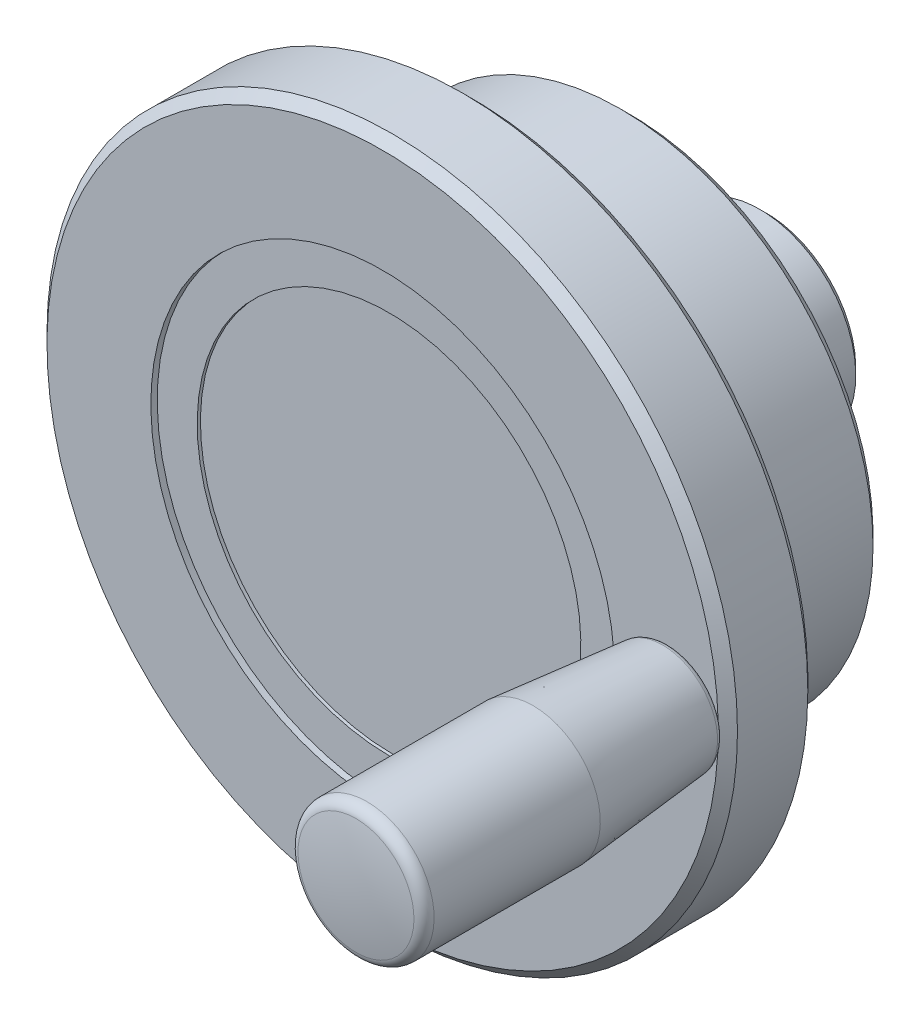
ISO-10303-21;
HEADER;
FILE_DESCRIPTION(('STEP AP214'),'2;1');
FILE_NAME('part.step','',(''),(''),'','','');
FILE_SCHEMA(('AUTOMOTIVE_DESIGN { 1 0 10303 214 1 1 1 1 }'));
ENDSEC;
DATA;
#1=APPLICATION_CONTEXT('core data for automotive mechanical design processes');
#2=APPLICATION_PROTOCOL_DEFINITION('international standard','automotive_design',2000,#1);
#3=PRODUCT_CONTEXT('',#1,'mechanical');
#4=PRODUCT('Part','Part','',(#3));
#5=PRODUCT_RELATED_PRODUCT_CATEGORY('part','',(#4));
#6=PRODUCT_DEFINITION_FORMATION('','',#4);
#7=PRODUCT_DEFINITION_CONTEXT('part definition',#1,'design');
#8=PRODUCT_DEFINITION('design','',#6,#7);
#9=PRODUCT_DEFINITION_SHAPE('','',#8);
#10=(LENGTH_UNIT() NAMED_UNIT(*) SI_UNIT(.MILLI.,.METRE.));
#11=(NAMED_UNIT(*) PLANE_ANGLE_UNIT() SI_UNIT($,.RADIAN.));
#12=(NAMED_UNIT(*) SI_UNIT($,.STERADIAN.) SOLID_ANGLE_UNIT());
#13=UNCERTAINTY_MEASURE_WITH_UNIT(LENGTH_MEASURE(1.E-05),#10,'distance_accuracy_value','');
#14=(GEOMETRIC_REPRESENTATION_CONTEXT(3) GLOBAL_UNCERTAINTY_ASSIGNED_CONTEXT((#13)) GLOBAL_UNIT_ASSIGNED_CONTEXT((#10,
#11,#12)) REPRESENTATION_CONTEXT('',''));
#15=CARTESIAN_POINT('',(0.,0.,0.));
#16=DIRECTION('',(0.,0.,1.));
#17=DIRECTION('',(1.,0.,0.));
#18=AXIS2_PLACEMENT_3D('',#15,#16,#17);
#19=CARTESIAN_POINT('',(0.,0.,0.));
#20=DIRECTION('',(0.,0.,1.));
#21=DIRECTION('',(0.,-1.,0.));
#22=AXIS2_PLACEMENT_3D('',#19,#20,#21);
#23=PLANE('',#22);
#24=CARTESIAN_POINT('',(0.,0.,0.));
#25=DIRECTION('',(0.,0.,1.));
#26=DIRECTION('',(0.,-1.,0.));
#27=AXIS2_PLACEMENT_3D('',#24,#25,#26);
#28=CIRCLE('',#27,14.);
#29=CARTESIAN_POINT('',(0.,-14.,0.));
#30=VERTEX_POINT('',#29);
#31=EDGE_CURVE('E61',#30,#30,#28,.T.);
#32=ORIENTED_EDGE('',*,*,#31,.F.);
#33=EDGE_LOOP('',(#32));
#34=FACE_BOUND('',#33,.T.);
#35=ADVANCED_FACE('F12',(#34),#23,.F.);
#36=CARTESIAN_POINT('',(-52.5,0.,60.));
#37=DIRECTION('',(0.,0.,-1.));
#38=DIRECTION('',(0.,1.,0.));
#39=AXIS2_PLACEMENT_3D('',#36,#37,#38);
#40=PLANE('',#39);
#41=CARTESIAN_POINT('',(45.,0.,60.));
#42=DIRECTION('',(0.,0.,-1.));
#43=DIRECTION('',(0.,1.,0.));
#44=AXIS2_PLACEMENT_3D('',#41,#42,#43);
#45=CIRCLE('',#44,5.);
#46=CARTESIAN_POINT('',(45.,5.,60.));
#47=VERTEX_POINT('',#46);
#48=EDGE_CURVE('E94',#47,#47,#45,.T.);
#49=ORIENTED_EDGE('',*,*,#48,.T.);
#50=EDGE_LOOP('',(#49));
#51=FACE_BOUND('',#50,.T.);
#52=CARTESIAN_POINT('',(0.,0.,60.));
#53=DIRECTION('',(0.,0.,1.));
#54=DIRECTION('',(0.,-1.,0.));
#55=AXIS2_PLACEMENT_3D('',#52,#53,#54);
#56=CIRCLE('',#55,36.25);
#57=CARTESIAN_POINT('',(0.,-36.25,60.));
#58=VERTEX_POINT('',#57);
#59=EDGE_CURVE('E67',#58,#58,#56,.T.);
#60=ORIENTED_EDGE('',*,*,#59,.F.);
#61=EDGE_LOOP('',(#60));
#62=FACE_BOUND('',#61,.T.);
#63=CARTESIAN_POINT('',(0.,0.,60.));
#64=DIRECTION('',(0.,0.,1.));
#65=DIRECTION('',(0.,-1.,0.));
#66=AXIS2_PLACEMENT_3D('',#63,#64,#65);
#67=CIRCLE('',#66,52.5);
#68=CARTESIAN_POINT('',(0.,-52.5,60.));
#69=VERTEX_POINT('',#68);
#70=EDGE_CURVE('E8',#69,#69,#67,.T.);
#71=ORIENTED_EDGE('',*,*,#70,.T.);
#72=EDGE_LOOP('',(#71));
#73=FACE_BOUND('',#72,.T.);
#74=ADVANCED_FACE('F98',(#51,#62,#73),#40,.F.);
#75=CARTESIAN_POINT('',(0.,0.,60.));
#76=DIRECTION('',(0.,0.,-1.));
#77=DIRECTION('',(0.,1.,0.));
#78=AXIS2_PLACEMENT_3D('',#75,#76,#77);
#79=CONICAL_SURFACE('',#78,52.5,0.785398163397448);
#80=CARTESIAN_POINT('',(0.,0.,58.5));
#81=DIRECTION('',(0.,0.,1.));
#82=DIRECTION('',(0.,-1.,0.));
#83=AXIS2_PLACEMENT_3D('',#80,#81,#82);
#84=CIRCLE('',#83,54.);
#85=CARTESIAN_POINT('',(0.,-54.,58.5));
#86=VERTEX_POINT('',#85);
#87=EDGE_CURVE('E18',#86,#86,#84,.T.);
#88=ORIENTED_EDGE('',*,*,#87,.T.);
#89=EDGE_LOOP('',(#88));
#90=FACE_BOUND('',#89,.T.);
#91=ORIENTED_EDGE('',*,*,#70,.F.);
#92=EDGE_LOOP('',(#91));
#93=FACE_BOUND('',#92,.T.);
#94=ADVANCED_FACE('F120',(#90,#93),#79,.T.);
#95=CARTESIAN_POINT('',(0.,0.,67.681471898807));
#96=DIRECTION('',(0.,0.,1.));
#97=DIRECTION('',(0.,-1.,0.));
#98=AXIS2_PLACEMENT_3D('',#95,#96,#97);
#99=CYLINDRICAL_SURFACE('',#98,54.);
#100=ORIENTED_EDGE('',*,*,#87,.F.);
#101=EDGE_LOOP('',(#100));
#102=FACE_BOUND('',#101,.T.);
#103=CARTESIAN_POINT('',(0.,0.,47.5));
#104=DIRECTION('',(0.,0.,1.));
#105=DIRECTION('',(0.,-1.,0.));
#106=AXIS2_PLACEMENT_3D('',#103,#104,#105);
#107=CIRCLE('',#106,54.);
#108=CARTESIAN_POINT('',(0.,-54.,47.5));
#109=VERTEX_POINT('',#108);
#110=EDGE_CURVE('E22',#109,#109,#107,.T.);
#111=ORIENTED_EDGE('',*,*,#110,.T.);
#112=EDGE_LOOP('',(#111));
#113=FACE_BOUND('',#112,.T.);
#114=ADVANCED_FACE('F354',(#102,#113),#99,.T.);
#115=CARTESIAN_POINT('',(0.,0.,46.));
#116=DIRECTION('',(0.,0.,1.));
#117=DIRECTION('',(0.,-1.,0.));
#118=AXIS2_PLACEMENT_3D('',#115,#116,#117);
#119=CONICAL_SURFACE('',#118,52.5,0.785398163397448);
#120=ORIENTED_EDGE('',*,*,#110,.F.);
#121=EDGE_LOOP('',(#120));
#122=FACE_BOUND('',#121,.T.);
#123=CARTESIAN_POINT('',(0.,0.,46.));
#124=DIRECTION('',(0.,0.,1.));
#125=DIRECTION('',(0.,-1.,0.));
#126=AXIS2_PLACEMENT_3D('',#123,#124,#125);
#127=CIRCLE('',#126,52.5);
#128=CARTESIAN_POINT('',(0.,-52.5,46.));
#129=VERTEX_POINT('',#128);
#130=EDGE_CURVE('E26',#129,#129,#127,.T.);
#131=ORIENTED_EDGE('',*,*,#130,.T.);
#132=EDGE_LOOP('',(#131));
#133=FACE_BOUND('',#132,.T.);
#134=ADVANCED_FACE('F345',(#122,#133),#119,.T.);
#135=CARTESIAN_POINT('',(-52.5,0.,46.));
#136=DIRECTION('',(0.,0.,-1.));
#137=DIRECTION('',(0.,1.,0.));
#138=AXIS2_PLACEMENT_3D('',#135,#136,#137);
#139=PLANE('',#138);
#140=CARTESIAN_POINT('',(0.,0.,46.));
#141=DIRECTION('',(0.,0.,1.));
#142=DIRECTION('',(0.,-1.,0.));
#143=AXIS2_PLACEMENT_3D('',#140,#141,#142);
#144=CIRCLE('',#143,41.5);
#145=CARTESIAN_POINT('',(0.,-41.5,46.));
#146=VERTEX_POINT('',#145);
#147=EDGE_CURVE('E31',#146,#146,#144,.T.);
#148=ORIENTED_EDGE('',*,*,#147,.T.);
#149=EDGE_LOOP('',(#148));
#150=FACE_BOUND('',#149,.T.);
#151=ORIENTED_EDGE('',*,*,#130,.F.);
#152=EDGE_LOOP('',(#151));
#153=FACE_BOUND('',#152,.T.);
#154=ADVANCED_FACE('F336',(#150,#153),#139,.T.);
#155=CARTESIAN_POINT('',(0.,0.,44.));
#156=DIRECTION('',(0.,0.,1.));
#157=DIRECTION('',(0.,-1.,0.));
#158=AXIS2_PLACEMENT_3D('',#155,#156,#157);
#159=TOROIDAL_SURFACE('',#158,41.5,2.);
#160=ORIENTED_EDGE('',*,*,#147,.F.);
#161=EDGE_LOOP('',(#160));
#162=FACE_BOUND('',#161,.T.);
#163=CARTESIAN_POINT('',(0.,0.,44.));
#164=DIRECTION('',(0.,0.,1.));
#165=DIRECTION('',(0.,-1.,0.));
#166=AXIS2_PLACEMENT_3D('',#163,#164,#165);
#167=CIRCLE('',#166,39.5);
#168=CARTESIAN_POINT('',(0.,-39.5,44.));
#169=VERTEX_POINT('',#168);
#170=EDGE_CURVE('E34',#169,#169,#167,.T.);
#171=ORIENTED_EDGE('',*,*,#170,.T.);
#172=EDGE_LOOP('',(#171));
#173=FACE_BOUND('',#172,.T.);
#174=ADVANCED_FACE('F327',(#162,#173),#159,.F.);
#175=CARTESIAN_POINT('',(0.,0.,67.681471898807));
#176=DIRECTION('',(0.,0.,1.));
#177=DIRECTION('',(0.,-1.,0.));
#178=AXIS2_PLACEMENT_3D('',#175,#176,#177);
#179=CYLINDRICAL_SURFACE('',#178,39.5);
#180=CARTESIAN_POINT('',(0.,0.,22.8));
#181=DIRECTION('',(0.,0.,1.));
#182=DIRECTION('',(0.,-1.,0.));
#183=AXIS2_PLACEMENT_3D('',#180,#181,#182);
#184=CIRCLE('',#183,39.5);
#185=CARTESIAN_POINT('',(0.,-39.5,22.8));
#186=VERTEX_POINT('',#185);
#187=EDGE_CURVE('E37',#186,#186,#184,.T.);
#188=ORIENTED_EDGE('',*,*,#187,.T.);
#189=EDGE_LOOP('',(#188));
#190=FACE_BOUND('',#189,.T.);
#191=ORIENTED_EDGE('',*,*,#170,.F.);
#192=EDGE_LOOP('',(#191));
#193=FACE_BOUND('',#192,.T.);
#194=ADVANCED_FACE('F318',(#190,#193),#179,.T.);
#195=CARTESIAN_POINT('',(0.,0.,21.3));
#196=DIRECTION('',(0.,0.,1.));
#197=DIRECTION('',(0.,-1.,0.));
#198=AXIS2_PLACEMENT_3D('',#195,#196,#197);
#199=CONICAL_SURFACE('',#198,38.,0.785398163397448);
#200=ORIENTED_EDGE('',*,*,#187,.F.);
#201=EDGE_LOOP('',(#200));
#202=FACE_BOUND('',#201,.T.);
#203=CARTESIAN_POINT('',(0.,0.,21.3));
#204=DIRECTION('',(0.,0.,1.));
#205=DIRECTION('',(0.,-1.,0.));
#206=AXIS2_PLACEMENT_3D('',#203,#204,#205);
#207=CIRCLE('',#206,38.);
#208=CARTESIAN_POINT('',(0.,-38.,21.3));
#209=VERTEX_POINT('',#208);
#210=EDGE_CURVE('E40',#209,#209,#207,.T.);
#211=ORIENTED_EDGE('',*,*,#210,.T.);
#212=EDGE_LOOP('',(#211));
#213=FACE_BOUND('',#212,.T.);
#214=ADVANCED_FACE('F309',(#202,#213),#199,.T.);
#215=CARTESIAN_POINT('',(-25.,0.,21.3));
#216=DIRECTION('',(0.,0.,1.));
#217=DIRECTION('',(0.,-1.,0.));
#218=AXIS2_PLACEMENT_3D('',#215,#216,#217);
#219=PLANE('',#218);
#220=ORIENTED_EDGE('',*,*,#210,.F.);
#221=EDGE_LOOP('',(#220));
#222=FACE_BOUND('',#221,.T.);
#223=CARTESIAN_POINT('',(0.,0.,21.3));
#224=DIRECTION('',(0.,0.,1.));
#225=DIRECTION('',(0.,-1.,0.));
#226=AXIS2_PLACEMENT_3D('',#223,#224,#225);
#227=CIRCLE('',#226,25.);
#228=CARTESIAN_POINT('',(0.,-25.,21.3));
#229=VERTEX_POINT('',#228);
#230=EDGE_CURVE('E43',#229,#229,#227,.T.);
#231=ORIENTED_EDGE('',*,*,#230,.T.);
#232=EDGE_LOOP('',(#231));
#233=FACE_BOUND('',#232,.T.);
#234=ADVANCED_FACE('F300',(#222,#233),#219,.F.);
#235=CARTESIAN_POINT('',(0.,0.,19.3));
#236=DIRECTION('',(0.,0.,1.));
#237=DIRECTION('',(0.,-1.,0.));
#238=AXIS2_PLACEMENT_3D('',#235,#236,#237);
#239=TOROIDAL_SURFACE('',#238,25.,2.);
#240=ORIENTED_EDGE('',*,*,#230,.F.);
#241=EDGE_LOOP('',(#240));
#242=FACE_BOUND('',#241,.T.);
#243=CARTESIAN_POINT('',(0.,0.,19.3));
#244=DIRECTION('',(0.,0.,1.));
#245=DIRECTION('',(0.,-1.,0.));
#246=AXIS2_PLACEMENT_3D('',#243,#244,#245);
#247=CIRCLE('',#246,23.);
#248=CARTESIAN_POINT('',(0.,-23.,19.3));
#249=VERTEX_POINT('',#248);
#250=EDGE_CURVE('E46',#249,#249,#247,.T.);
#251=ORIENTED_EDGE('',*,*,#250,.T.);
#252=EDGE_LOOP('',(#251));
#253=FACE_BOUND('',#252,.T.);
#254=ADVANCED_FACE('F291',(#242,#253),#239,.F.);
#255=CARTESIAN_POINT('',(0.,0.,67.681471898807));
#256=DIRECTION('',(0.,0.,1.));
#257=DIRECTION('',(0.,-1.,0.));
#258=AXIS2_PLACEMENT_3D('',#255,#256,#257);
#259=CYLINDRICAL_SURFACE('',#258,23.);
#260=CARTESIAN_POINT('',(0.,0.,13.9));
#261=DIRECTION('',(0.,0.,1.));
#262=DIRECTION('',(0.,-1.,0.));
#263=AXIS2_PLACEMENT_3D('',#260,#261,#262);
#264=CIRCLE('',#263,23.);
#265=CARTESIAN_POINT('',(0.,-23.,13.9));
#266=VERTEX_POINT('',#265);
#267=EDGE_CURVE('E49',#266,#266,#264,.T.);
#268=ORIENTED_EDGE('',*,*,#267,.T.);
#269=EDGE_LOOP('',(#268));
#270=FACE_BOUND('',#269,.T.);
#271=ORIENTED_EDGE('',*,*,#250,.F.);
#272=EDGE_LOOP('',(#271));
#273=FACE_BOUND('',#272,.T.);
#274=ADVANCED_FACE('F282',(#270,#273),#259,.T.);
#275=CARTESIAN_POINT('',(0.,0.,13.9999984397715));
#276=DIRECTION('',(0.,0.,1.));
#277=DIRECTION('',(0.,-1.,0.));
#278=AXIS2_PLACEMENT_3D('',#275,#276,#277);
#279=TOROIDAL_SURFACE('',#278,21.0025014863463,2.00000000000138);
#280=CARTESIAN_POINT('',(0.,0.,12.));
#281=DIRECTION('',(0.,0.,1.));
#282=DIRECTION('',(0.,-1.,0.));
#283=AXIS2_PLACEMENT_3D('',#280,#281,#282);
#284=CIRCLE('',#283,21.0000033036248);
#285=CARTESIAN_POINT('',(0.,-21.0000033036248,12.));
#286=VERTEX_POINT('',#285);
#287=EDGE_CURVE('E52',#286,#286,#284,.T.);
#288=ORIENTED_EDGE('',*,*,#287,.T.);
#289=EDGE_LOOP('',(#288));
#290=FACE_BOUND('',#289,.T.);
#291=ORIENTED_EDGE('',*,*,#267,.F.);
#292=EDGE_LOOP('',(#291));
#293=FACE_BOUND('',#292,.T.);
#294=ADVANCED_FACE('F274',(#290,#293),#279,.T.);
#295=CARTESIAN_POINT('',(-15.,0.,12.));
#296=DIRECTION('',(0.,0.,1.));
#297=DIRECTION('',(0.,-1.,0.));
#298=AXIS2_PLACEMENT_3D('',#295,#296,#297);
#299=PLANE('',#298);
#300=ORIENTED_EDGE('',*,*,#287,.F.);
#301=EDGE_LOOP('',(#300));
#302=FACE_BOUND('',#301,.T.);
#303=CARTESIAN_POINT('',(0.,0.,12.));
#304=DIRECTION('',(0.,0.,1.));
#305=DIRECTION('',(0.,-1.,0.));
#306=AXIS2_PLACEMENT_3D('',#303,#304,#305);
#307=CIRCLE('',#306,15.);
#308=CARTESIAN_POINT('',(0.,-15.,12.));
#309=VERTEX_POINT('',#308);
#310=EDGE_CURVE('E55',#309,#309,#307,.T.);
#311=ORIENTED_EDGE('',*,*,#310,.T.);
#312=EDGE_LOOP('',(#311));
#313=FACE_BOUND('',#312,.T.);
#314=ADVANCED_FACE('F138',(#302,#313),#299,.F.);
#315=CARTESIAN_POINT('',(0.,0.,67.681471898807));
#316=DIRECTION('',(0.,0.,1.));
#317=DIRECTION('',(0.,-1.,0.));
#318=AXIS2_PLACEMENT_3D('',#315,#316,#317);
#319=CYLINDRICAL_SURFACE('',#318,15.);
#320=CARTESIAN_POINT('',(0.,0.,1.));
#321=DIRECTION('',(0.,0.,1.));
#322=DIRECTION('',(0.,-1.,0.));
#323=AXIS2_PLACEMENT_3D('',#320,#321,#322);
#324=CIRCLE('',#323,15.);
#325=CARTESIAN_POINT('',(0.,-15.,1.));
#326=VERTEX_POINT('',#325);
#327=EDGE_CURVE('E58',#326,#326,#324,.T.);
#328=ORIENTED_EDGE('',*,*,#327,.T.);
#329=EDGE_LOOP('',(#328));
#330=FACE_BOUND('',#329,.T.);
#331=ORIENTED_EDGE('',*,*,#310,.F.);
#332=EDGE_LOOP('',(#331));
#333=FACE_BOUND('',#332,.T.);
#334=ADVANCED_FACE('F126',(#330,#333),#319,.T.);
#335=CARTESIAN_POINT('',(0.,0.,0.));
#336=DIRECTION('',(0.,0.,1.));
#337=DIRECTION('',(0.,-1.,0.));
#338=AXIS2_PLACEMENT_3D('',#335,#336,#337);
#339=CONICAL_SURFACE('',#338,14.,0.785398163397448);
#340=ORIENTED_EDGE('',*,*,#327,.F.);
#341=EDGE_LOOP('',(#340));
#342=FACE_BOUND('',#341,.T.);
#343=ORIENTED_EDGE('',*,*,#31,.T.);
#344=EDGE_LOOP('',(#343));
#345=FACE_BOUND('',#344,.T.);
#346=ADVANCED_FACE('F123',(#342,#345),#339,.T.);
#347=CARTESIAN_POINT('',(0.,0.,59.));
#348=DIRECTION('',(0.,0.,1.));
#349=DIRECTION('',(0.,-1.,0.));
#350=AXIS2_PLACEMENT_3D('',#347,#348,#349);
#351=CYLINDRICAL_SURFACE('',#350,36.25);
#352=CARTESIAN_POINT('',(0.,0.,59.));
#353=DIRECTION('',(0.,0.,1.));
#354=DIRECTION('',(0.,-1.,0.));
#355=AXIS2_PLACEMENT_3D('',#352,#353,#354);
#356=CIRCLE('',#355,36.25);
#357=CARTESIAN_POINT('',(0.,-36.25,59.));
#358=VERTEX_POINT('',#357);
#359=EDGE_CURVE('E64',#358,#358,#356,.T.);
#360=ORIENTED_EDGE('',*,*,#359,.F.);
#361=EDGE_LOOP('',(#360));
#362=FACE_BOUND('',#361,.T.);
#363=ORIENTED_EDGE('',*,*,#59,.T.);
#364=EDGE_LOOP('',(#363));
#365=FACE_BOUND('',#364,.T.);
#366=ADVANCED_FACE('F125',(#362,#365),#351,.F.);
#367=CARTESIAN_POINT('',(0.,0.,59.));
#368=DIRECTION('',(0.,0.,1.));
#369=DIRECTION('',(0.,-1.,0.));
#370=AXIS2_PLACEMENT_3D('',#367,#368,#369);
#371=PLANE('',#370);
#372=CARTESIAN_POINT('',(0.,0.,59.));
#373=DIRECTION('',(0.,0.,1.));
#374=DIRECTION('',(0.,-1.,0.));
#375=AXIS2_PLACEMENT_3D('',#372,#373,#374);
#376=CIRCLE('',#375,30.);
#377=CARTESIAN_POINT('',(0.,-30.,59.));
#378=VERTEX_POINT('',#377);
#379=EDGE_CURVE('E70',#378,#378,#376,.T.);
#380=ORIENTED_EDGE('',*,*,#379,.F.);
#381=EDGE_LOOP('',(#380));
#382=FACE_BOUND('',#381,.T.);
#383=ORIENTED_EDGE('',*,*,#359,.T.);
#384=EDGE_LOOP('',(#383));
#385=FACE_BOUND('',#384,.T.);
#386=ADVANCED_FACE('F129',(#382,#385),#371,.T.);
#387=CARTESIAN_POINT('',(0.,0.,58.5));
#388=DIRECTION('',(0.,0.,1.));
#389=DIRECTION('',(0.,-1.,0.));
#390=AXIS2_PLACEMENT_3D('',#387,#388,#389);
#391=CYLINDRICAL_SURFACE('',#390,30.);
#392=ORIENTED_EDGE('',*,*,#379,.T.);
#393=EDGE_LOOP('',(#392));
#394=FACE_BOUND('',#393,.T.);
#395=CARTESIAN_POINT('',(0.,0.,58.5));
#396=DIRECTION('',(0.,0.,1.));
#397=DIRECTION('',(0.,-1.,0.));
#398=AXIS2_PLACEMENT_3D('',#395,#396,#397);
#399=CIRCLE('',#398,30.);
#400=CARTESIAN_POINT('',(0.,-30.,58.5));
#401=VERTEX_POINT('',#400);
#402=EDGE_CURVE('E73',#401,#401,#399,.T.);
#403=ORIENTED_EDGE('',*,*,#402,.F.);
#404=EDGE_LOOP('',(#403));
#405=FACE_BOUND('',#404,.T.);
#406=ADVANCED_FACE('F143',(#394,#405),#391,.F.);
#407=CARTESIAN_POINT('',(0.,0.,58.5));
#408=DIRECTION('',(0.,0.,1.));
#409=DIRECTION('',(0.,-1.,0.));
#410=AXIS2_PLACEMENT_3D('',#407,#408,#409);
#411=PLANE('',#410);
#412=ORIENTED_EDGE('',*,*,#402,.T.);
#413=EDGE_LOOP('',(#412));
#414=FACE_BOUND('',#413,.T.);
#415=ADVANCED_FACE('F137',(#414),#411,.T.);
#416=CARTESIAN_POINT('',(45.,0.,60.));
#417=DIRECTION('',(0.,-1.,0.));
#418=DIRECTION('',(0.,0.,-1.));
#419=AXIS2_PLACEMENT_3D('',#416,#417,#418);
#420=SPHERICAL_SURFACE('',#419,50.);
#421=CARTESIAN_POINT('',(45.,0.,60.));
#422=DIRECTION('',(0.,0.,-1.));
#423=DIRECTION('',(0.,1.,0.));
#424=AXIS2_PLACEMENT_3D('',#421,#422,#423);
#425=SPHERICAL_SURFACE('',#424,50.);
#426=CARTESIAN_POINT('',(45.,0.,109.170957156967));
#427=DIRECTION('',(0.,0.,-1.));
#428=DIRECTION('',(0.,1.,0.));
#429=AXIS2_PLACEMENT_3D('',#426,#427,#428);
#430=CIRCLE('',#429,9.06735751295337);
#431=CARTESIAN_POINT('',(45.,9.06735751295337,109.170957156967));
#432=VERTEX_POINT('',#431);
#433=EDGE_CURVE('E76',#432,#432,#430,.T.);
#434=ORIENTED_EDGE('',*,*,#433,.F.);
#435=EDGE_LOOP('',(#434));
#436=FACE_BOUND('',#435,.T.);
#437=ADVANCED_FACE('F152',(#436),#425,.T.);
#438=CARTESIAN_POINT('',(45.,0.,107.449973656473));
#439=DIRECTION('',(0.,0.,-1.));
#440=DIRECTION('',(0.,1.,0.));
#441=AXIS2_PLACEMENT_3D('',#438,#439,#440);
#442=TOROIDAL_SURFACE('',#441,8.75,1.75);
#443=CARTESIAN_POINT('',(45.,0.,107.449973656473));
#444=DIRECTION('',(0.,0.,-1.));
#445=DIRECTION('',(0.,1.,0.));
#446=AXIS2_PLACEMENT_3D('',#443,#444,#445);
#447=CIRCLE('',#446,10.5);
#448=CARTESIAN_POINT('',(45.,10.5,107.449973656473));
#449=VERTEX_POINT('',#448);
#450=EDGE_CURVE('E79',#449,#449,#447,.T.);
#451=ORIENTED_EDGE('',*,*,#450,.F.);
#452=EDGE_LOOP('',(#451));
#453=FACE_BOUND('',#452,.T.);
#454=ORIENTED_EDGE('',*,*,#433,.T.);
#455=EDGE_LOOP('',(#454));
#456=FACE_BOUND('',#455,.T.);
#457=ADVANCED_FACE('F161',(#453,#456),#442,.T.);
#458=CARTESIAN_POINT('',(45.,0.,53.1581982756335));
#459=DIRECTION('',(0.,0.,-1.));
#460=DIRECTION('',(0.,1.,0.));
#461=AXIS2_PLACEMENT_3D('',#458,#459,#460);
#462=CYLINDRICAL_SURFACE('',#461,10.5);
#463=CARTESIAN_POINT('',(45.,0.,81.457789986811));
#464=DIRECTION('',(0.,0.,-1.));
#465=DIRECTION('',(0.,1.,0.));
#466=AXIS2_PLACEMENT_3D('',#463,#464,#465);
#467=CIRCLE('',#466,10.5);
#468=CARTESIAN_POINT('',(45.,10.5,81.457789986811));
#469=VERTEX_POINT('',#468);
#470=EDGE_CURVE('E82',#469,#469,#467,.T.);
#471=ORIENTED_EDGE('',*,*,#470,.F.);
#472=EDGE_LOOP('',(#471));
#473=FACE_BOUND('',#472,.T.);
#474=ORIENTED_EDGE('',*,*,#450,.T.);
#475=EDGE_LOOP('',(#474));
#476=FACE_BOUND('',#475,.T.);
#477=ADVANCED_FACE('F165',(#473,#476),#462,.T.);
#478=CARTESIAN_POINT('',(45.,0.,61.2058916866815));
#479=DIRECTION('',(0.,0.,1.));
#480=DIRECTION('',(0.,-1.,0.));
#481=AXIS2_PLACEMENT_3D('',#478,#479,#480);
#482=CONICAL_SURFACE('',#481,8.58563197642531,0.0942477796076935);
#483=ORIENTED_EDGE('',*,*,#470,.T.);
#484=EDGE_LOOP('',(#483));
#485=FACE_BOUND('',#484,.T.);
#486=CARTESIAN_POINT('',(45.,0.,61.2058916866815));
#487=DIRECTION('',(0.,0.,-1.));
#488=DIRECTION('',(0.,1.,0.));
#489=AXIS2_PLACEMENT_3D('',#486,#487,#488);
#490=CIRCLE('',#489,8.58563197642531);
#491=CARTESIAN_POINT('',(45.,8.58563197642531,61.2058916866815));
#492=VERTEX_POINT('',#491);
#493=EDGE_CURVE('E85',#492,#492,#490,.T.);
#494=ORIENTED_EDGE('',*,*,#493,.F.);
#495=EDGE_LOOP('',(#494));
#496=FACE_BOUND('',#495,.T.);
#497=ADVANCED_FACE('F169',(#485,#496),#482,.T.);
#498=CARTESIAN_POINT('',(45.,0.,61.3));
#499=DIRECTION('',(0.,0.,-1.));
#500=DIRECTION('',(0.,1.,0.));
#501=AXIS2_PLACEMENT_3D('',#498,#499,#500);
#502=TOROIDAL_SURFACE('',#501,7.59007001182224,1.);
#503=CARTESIAN_POINT('',(45.,0.,60.3));
#504=DIRECTION('',(0.,0.,-1.));
#505=DIRECTION('',(0.,1.,0.));
#506=AXIS2_PLACEMENT_3D('',#503,#504,#505);
#507=CIRCLE('',#506,7.59007001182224);
#508=CARTESIAN_POINT('',(45.,7.59007001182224,60.3));
#509=VERTEX_POINT('',#508);
#510=EDGE_CURVE('E88',#509,#509,#507,.T.);
#511=ORIENTED_EDGE('',*,*,#510,.F.);
#512=EDGE_LOOP('',(#511));
#513=FACE_BOUND('',#512,.T.);
#514=ORIENTED_EDGE('',*,*,#493,.T.);
#515=EDGE_LOOP('',(#514));
#516=FACE_BOUND('',#515,.T.);
#517=ADVANCED_FACE('F111',(#513,#516),#502,.T.);
#518=CARTESIAN_POINT('',(40.,0.,60.3));
#519=DIRECTION('',(0.,0.,-1.));
#520=DIRECTION('',(0.,1.,0.));
#521=AXIS2_PLACEMENT_3D('',#518,#519,#520);
#522=PLANE('',#521);
#523=ORIENTED_EDGE('',*,*,#510,.T.);
#524=EDGE_LOOP('',(#523));
#525=FACE_BOUND('',#524,.T.);
#526=CARTESIAN_POINT('',(45.,0.,60.3));
#527=DIRECTION('',(0.,0.,-1.));
#528=DIRECTION('',(0.,1.,0.));
#529=AXIS2_PLACEMENT_3D('',#526,#527,#528);
#530=CIRCLE('',#529,5.);
#531=CARTESIAN_POINT('',(45.,5.,60.3));
#532=VERTEX_POINT('',#531);
#533=EDGE_CURVE('E91',#532,#532,#530,.T.);
#534=ORIENTED_EDGE('',*,*,#533,.F.);
#535=EDGE_LOOP('',(#534));
#536=FACE_BOUND('',#535,.T.);
#537=ADVANCED_FACE('F103',(#525,#536),#522,.T.);
#538=CARTESIAN_POINT('',(45.,0.,53.1581982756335));
#539=DIRECTION('',(0.,0.,-1.));
#540=DIRECTION('',(0.,1.,0.));
#541=AXIS2_PLACEMENT_3D('',#538,#539,#540);
#542=CYLINDRICAL_SURFACE('',#541,5.);
#543=ORIENTED_EDGE('',*,*,#533,.T.);
#544=EDGE_LOOP('',(#543));
#545=FACE_BOUND('',#544,.T.);
#546=ORIENTED_EDGE('',*,*,#48,.F.);
#547=EDGE_LOOP('',(#546));
#548=FACE_BOUND('',#547,.T.);
#549=ADVANCED_FACE('F101',(#545,#548),#542,.T.);
#550=CLOSED_SHELL('',(#35,#74,#94,#114,#134,#154,#174,#194,#214,#234,#254,#274,#294,#314,#334,
#346,#366,#386,#406,#415,#437,#457,#477,#497,#517,#537,#549));
#551=MANIFOLD_SOLID_BREP('B1',#550);
#552=ADVANCED_BREP_SHAPE_REPRESENTATION('',(#18,#551),#14);
#553=SHAPE_DEFINITION_REPRESENTATION(#9,#552);
ENDSEC;
END-ISO-10303-21;
